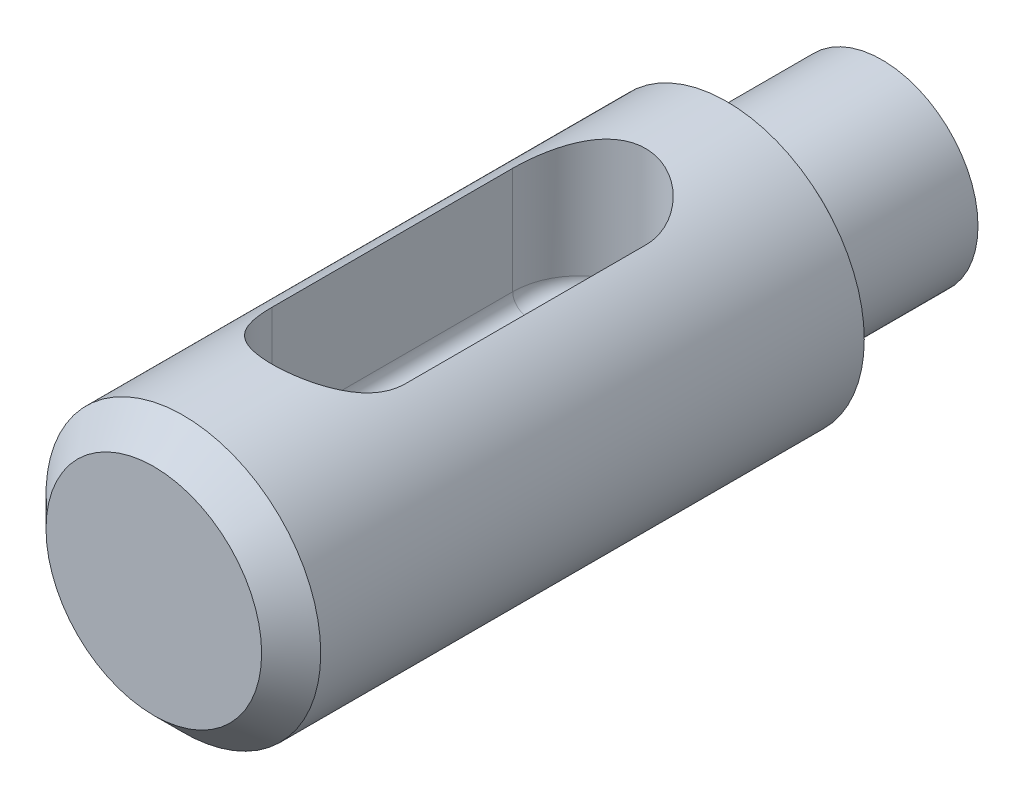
ISO-10303-21;
HEADER;
FILE_DESCRIPTION(('STEP AP214'),'2;1');
FILE_NAME('part.step','',(''),(''),'','','');
FILE_SCHEMA(('AUTOMOTIVE_DESIGN { 1 0 10303 214 1 1 1 1 }'));
ENDSEC;
DATA;
#1=APPLICATION_CONTEXT('core data for automotive mechanical design processes');
#2=APPLICATION_PROTOCOL_DEFINITION('international standard','automotive_design',2000,#1);
#3=PRODUCT_CONTEXT('',#1,'mechanical');
#4=PRODUCT('Part','Part','',(#3));
#5=PRODUCT_RELATED_PRODUCT_CATEGORY('part','',(#4));
#6=PRODUCT_DEFINITION_FORMATION('','',#4);
#7=PRODUCT_DEFINITION_CONTEXT('part definition',#1,'design');
#8=PRODUCT_DEFINITION('design','',#6,#7);
#9=PRODUCT_DEFINITION_SHAPE('','',#8);
#10=(LENGTH_UNIT() NAMED_UNIT(*) SI_UNIT(.MILLI.,.METRE.));
#11=(NAMED_UNIT(*) PLANE_ANGLE_UNIT() SI_UNIT($,.RADIAN.));
#12=(NAMED_UNIT(*) SI_UNIT($,.STERADIAN.) SOLID_ANGLE_UNIT());
#13=UNCERTAINTY_MEASURE_WITH_UNIT(LENGTH_MEASURE(1.E-05),#10,'distance_accuracy_value','');
#14=(GEOMETRIC_REPRESENTATION_CONTEXT(3) GLOBAL_UNCERTAINTY_ASSIGNED_CONTEXT((#13)) GLOBAL_UNIT_ASSIGNED_CONTEXT((#10,
#11,#12)) REPRESENTATION_CONTEXT('',''));
#15=CARTESIAN_POINT('',(0.,0.,0.));
#16=DIRECTION('',(0.,0.,1.));
#17=DIRECTION('',(1.,0.,0.));
#18=AXIS2_PLACEMENT_3D('',#15,#16,#17);
#19=CARTESIAN_POINT('',(0.,0.,0.));
#20=DIRECTION('',(0.,0.,-1.));
#21=DIRECTION('',(-1.,0.,0.));
#22=AXIS2_PLACEMENT_3D('',#19,#20,#21);
#23=PLANE('',#22);
#24=CARTESIAN_POINT('',(0.,0.,0.));
#25=DIRECTION('',(0.,0.,1.));
#26=DIRECTION('',(1.,0.,0.));
#27=AXIS2_PLACEMENT_3D('',#24,#25,#26);
#28=CIRCLE('',#27,1.8542);
#29=CARTESIAN_POINT('',(1.8542,0.,0.));
#30=VERTEX_POINT('',#29);
#31=EDGE_CURVE('E136',#30,#30,#28,.T.);
#32=ORIENTED_EDGE('',*,*,#31,.T.);
#33=EDGE_LOOP('',(#32));
#34=FACE_BOUND('',#33,.T.);
#35=ADVANCED_FACE('F33',(#34),#23,.F.);
#36=CARTESIAN_POINT('',(-1.651,0.,-12.5222));
#37=DIRECTION('',(0.,0.,1.));
#38=DIRECTION('',(1.,0.,0.));
#39=AXIS2_PLACEMENT_3D('',#36,#37,#38);
#40=PLANE('',#39);
#41=CARTESIAN_POINT('',(0.,0.,-12.5222));
#42=DIRECTION('',(0.,0.,1.));
#43=DIRECTION('',(1.,0.,0.));
#44=AXIS2_PLACEMENT_3D('',#41,#42,#43);
#45=CIRCLE('',#44,1.651);
#46=CARTESIAN_POINT('',(1.651,0.,-12.5222));
#47=VERTEX_POINT('',#46);
#48=EDGE_CURVE('E154',#47,#47,#45,.T.);
#49=ORIENTED_EDGE('',*,*,#48,.F.);
#50=EDGE_LOOP('',(#49));
#51=FACE_BOUND('',#50,.T.);
#52=ADVANCED_FACE('F197',(#51),#40,.F.);
#53=CARTESIAN_POINT('',(0.,0.,0.));
#54=DIRECTION('',(0.,0.,1.));
#55=DIRECTION('',(1.,0.,0.));
#56=AXIS2_PLACEMENT_3D('',#53,#54,#55);
#57=CYLINDRICAL_SURFACE('',#56,1.651);
#58=CARTESIAN_POINT('',(0.,0.,-10.3632));
#59=DIRECTION('',(0.,0.,1.));
#60=DIRECTION('',(1.,0.,0.));
#61=AXIS2_PLACEMENT_3D('',#58,#59,#60);
#62=CIRCLE('',#61,1.651);
#63=CARTESIAN_POINT('',(1.651,0.,-10.3632));
#64=VERTEX_POINT('',#63);
#65=EDGE_CURVE('E151',#64,#64,#62,.T.);
#66=ORIENTED_EDGE('',*,*,#65,.F.);
#67=EDGE_LOOP('',(#66));
#68=FACE_BOUND('',#67,.T.);
#69=ORIENTED_EDGE('',*,*,#48,.T.);
#70=EDGE_LOOP('',(#69));
#71=FACE_BOUND('',#70,.T.);
#72=ADVANCED_FACE('F203',(#68,#71),#57,.T.);
#73=CARTESIAN_POINT('',(0.,0.,-10.3632));
#74=DIRECTION('',(0.,0.,1.));
#75=DIRECTION('',(1.,0.,0.));
#76=AXIS2_PLACEMENT_3D('',#73,#74,#75);
#77=TOROIDAL_SURFACE('',#76,2.159,0.508);
#78=CARTESIAN_POINT('',(0.,0.,-9.8552));
#79=DIRECTION('',(0.,0.,1.));
#80=DIRECTION('',(1.,0.,0.));
#81=AXIS2_PLACEMENT_3D('',#78,#79,#80);
#82=CIRCLE('',#81,2.159);
#83=CARTESIAN_POINT('',(2.159,0.,-9.8552));
#84=VERTEX_POINT('',#83);
#85=EDGE_CURVE('E148',#84,#84,#82,.T.);
#86=ORIENTED_EDGE('',*,*,#85,.F.);
#87=EDGE_LOOP('',(#86));
#88=FACE_BOUND('',#87,.T.);
#89=ORIENTED_EDGE('',*,*,#65,.T.);
#90=EDGE_LOOP('',(#89));
#91=FACE_BOUND('',#90,.T.);
#92=ADVANCED_FACE('F294',(#88,#91),#77,.F.);
#93=CARTESIAN_POINT('',(-2.3622,0.,-9.8552));
#94=DIRECTION('',(0.,0.,1.));
#95=DIRECTION('',(1.,0.,0.));
#96=AXIS2_PLACEMENT_3D('',#93,#94,#95);
#97=PLANE('',#96);
#98=CARTESIAN_POINT('',(0.,0.,-9.8552));
#99=DIRECTION('',(0.,0.,1.));
#100=DIRECTION('',(1.,0.,0.));
#101=AXIS2_PLACEMENT_3D('',#98,#99,#100);
#102=CIRCLE('',#101,2.3622);
#103=CARTESIAN_POINT('',(2.3622,0.,-9.8552));
#104=VERTEX_POINT('',#103);
#105=EDGE_CURVE('E145',#104,#104,#102,.T.);
#106=ORIENTED_EDGE('',*,*,#105,.F.);
#107=EDGE_LOOP('',(#106));
#108=FACE_BOUND('',#107,.T.);
#109=ORIENTED_EDGE('',*,*,#85,.T.);
#110=EDGE_LOOP('',(#109));
#111=FACE_BOUND('',#110,.T.);
#112=ADVANCED_FACE('F278',(#108,#111),#97,.F.);
#113=CARTESIAN_POINT('',(0.,0.,0.));
#114=DIRECTION('',(0.,0.,1.));
#115=DIRECTION('',(1.,0.,0.));
#116=AXIS2_PLACEMENT_3D('',#113,#114,#115);
#117=CYLINDRICAL_SURFACE('',#116,2.3622);
#118=DIRECTION('',(0.,0.,1.));
#119=VECTOR('',#118,1.);
#120=CARTESIAN_POINT('',(1.143,2.06725417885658,0.));
#121=LINE('',#120,#119);
#122=CARTESIAN_POINT('',(1.143,2.06725417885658,-7.3152));
#123=VERTEX_POINT('',#122);
#124=CARTESIAN_POINT('',(1.143,2.06725417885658,-3.175));
#125=VERTEX_POINT('',#124);
#126=EDGE_CURVE('E105',#123,#125,#121,.T.);
#127=ORIENTED_EDGE('',*,*,#126,.T.);
#128=CARTESIAN_POINT('',(1.143,2.06725417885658,-3.175));
#129=CARTESIAN_POINT('',(1.143002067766,2.06724859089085,-3.14491238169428));
#130=CARTESIAN_POINT('',(1.14181121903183,2.0679118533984,-3.1148416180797));
#131=CARTESIAN_POINT('',(1.13707538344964,2.07052157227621,-3.05495889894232));
#132=CARTESIAN_POINT('',(1.13353173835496,2.07246729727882,-3.02514680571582));
#133=CARTESIAN_POINT('',(1.11947603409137,2.0801155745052,-2.93675525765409));
#134=CARTESIAN_POINT('',(1.10553827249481,2.08763061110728,-2.8788382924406));
#135=CARTESIAN_POINT('',(1.06917353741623,2.10648239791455,-2.76658770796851));
#136=CARTESIAN_POINT('',(1.04676224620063,2.11781208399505,-2.71224768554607));
#137=CARTESIAN_POINT('',(0.994180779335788,2.14299851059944,-2.6080205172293));
#138=CARTESIAN_POINT('',(0.963999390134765,2.1568588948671,-2.55813994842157));
#139=CARTESIAN_POINT('',(0.89404672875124,2.1868293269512,-2.46013924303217));
#140=CARTESIAN_POINT('',(0.853719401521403,2.20303033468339,-2.41244391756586));
#141=CARTESIAN_POINT('',(0.765784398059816,2.23511824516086,-2.32417347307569));
#142=CARTESIAN_POINT('',(0.718174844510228,2.25100506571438,-2.28360019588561));
#143=CARTESIAN_POINT('',(0.613395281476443,2.28186231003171,-2.20824701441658));
#144=CARTESIAN_POINT('',(0.555814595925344,2.29671410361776,-2.17398505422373));
#145=CARTESIAN_POINT('',(0.434853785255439,2.32265073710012,-2.11582753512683));
#146=CARTESIAN_POINT('',(0.371477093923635,2.33373778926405,-2.09192588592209));
#147=CARTESIAN_POINT('',(0.245248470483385,2.35023750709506,-2.05683209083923));
#148=CARTESIAN_POINT('',(0.18264874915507,2.35598209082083,-2.04489228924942));
#149=CARTESIAN_POINT('',(0.0560894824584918,2.36238197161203,-2.03160819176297));
#150=CARTESIAN_POINT('',(-0.00786930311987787,2.36304004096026,-2.03025812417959));
#151=CARTESIAN_POINT('',(-0.129748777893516,2.35935787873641,-2.03788224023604));
#152=CARTESIAN_POINT('',(-0.187736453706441,2.35542095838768,-2.0460233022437));
#153=CARTESIAN_POINT('',(-0.301401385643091,2.34358952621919,-2.0709204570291));
#154=CARTESIAN_POINT('',(-0.35707851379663,2.33569479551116,-2.08767702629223));
#155=CARTESIAN_POINT('',(-0.465544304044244,2.31653561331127,-2.12946375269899));
#156=CARTESIAN_POINT('',(-0.518279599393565,2.30522411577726,-2.15460996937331));
#157=CARTESIAN_POINT('',(-0.618915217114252,2.28026858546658,-2.21231566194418));
#158=CARTESIAN_POINT('',(-0.666813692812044,2.26662366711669,-2.24487795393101));
#159=CARTESIAN_POINT('',(-0.761006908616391,2.23685295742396,-2.31986262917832));
#160=CARTESIAN_POINT('',(-0.806770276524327,2.22061441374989,-2.36290829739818));
#161=CARTESIAN_POINT('',(-0.890710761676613,2.18829854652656,-2.45596331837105));
#162=CARTESIAN_POINT('',(-0.928881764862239,2.17222136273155,-2.50597822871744));
#163=CARTESIAN_POINT('',(-0.998668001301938,2.14107343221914,-2.61505439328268));
#164=CARTESIAN_POINT('',(-1.02978338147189,2.12611284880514,-2.67446944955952));
#165=CARTESIAN_POINT('',(-1.08130530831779,2.10038213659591,-2.79854672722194));
#166=CARTESIAN_POINT('',(-1.10173607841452,2.08960254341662,-2.86319669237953));
#167=CARTESIAN_POINT('',(-1.12513225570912,2.07705732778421,-2.96953592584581));
#168=CARTESIAN_POINT('',(-1.1318082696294,2.07341326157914,-3.0102182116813));
#169=CARTESIAN_POINT('',(-1.14075105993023,2.06849806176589,-3.09225378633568));
#170=CARTESIAN_POINT('',(-1.14301243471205,2.06722983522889,-3.13360783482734));
#171=CARTESIAN_POINT('',(-1.143,2.06725417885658,-3.175));
#172=B_SPLINE_CURVE_WITH_KNOTS('',3,(#128,#129,#130,#131,#132,#133,#134,#135,#136,#137,#138,
#139,#140,#141,#142,#143,#144,#145,#146,#147,#148,#149,#150,#151,#152,#153,#154,#155,#156,#157,
#158,#159,#160,#161,#162,#163,#164,#165,#166,#167,#168,#169,#170,#171),.UNSPECIFIED.,.F.,.F.,(4,
2,2,2,2,2,2,2,2,2,2,2,2,2,2,2,2,2,2,2,2,4),(0.,0.0901998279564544,0.180348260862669,
0.359514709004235,0.538351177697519,0.717447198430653,0.910210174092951,1.10302292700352,
1.30783974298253,1.51253599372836,1.7034440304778,1.89424801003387,2.06948895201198,
2.24473958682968,2.42252270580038,2.60037344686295,2.79421436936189,2.98821076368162,
3.19330328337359,3.39792879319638,3.52180410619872,3.64583089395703),.UNSPECIFIED.);
#173=CARTESIAN_POINT('',(-1.143,2.06725417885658,-3.175));
#174=VERTEX_POINT('',#173);
#175=EDGE_CURVE('E110',#125,#174,#172,.T.);
#176=ORIENTED_EDGE('',*,*,#175,.T.);
#177=DIRECTION('',(0.,0.,1.));
#178=VECTOR('',#177,1.);
#179=CARTESIAN_POINT('',(-1.143,2.06725417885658,0.));
#180=LINE('',#179,#178);
#181=CARTESIAN_POINT('',(-1.143,2.06725417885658,-7.3152));
#182=VERTEX_POINT('',#181);
#183=EDGE_CURVE('E92',#174,#182,#180,.F.);
#184=ORIENTED_EDGE('',*,*,#183,.T.);
#185=CARTESIAN_POINT('',(-1.143,2.06725417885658,-7.3152));
#186=CARTESIAN_POINT('',(-1.143002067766,2.06724859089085,-7.34528761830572));
#187=CARTESIAN_POINT('',(-1.14181121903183,2.0679118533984,-7.37535838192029));
#188=CARTESIAN_POINT('',(-1.13707538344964,2.07052157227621,-7.43524110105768));
#189=CARTESIAN_POINT('',(-1.13353173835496,2.07246729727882,-7.46505319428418));
#190=CARTESIAN_POINT('',(-1.11947603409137,2.0801155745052,-7.55344474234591));
#191=CARTESIAN_POINT('',(-1.10553827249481,2.08763061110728,-7.6113617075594));
#192=CARTESIAN_POINT('',(-1.06917353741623,2.10648239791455,-7.72361229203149));
#193=CARTESIAN_POINT('',(-1.04676224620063,2.11781208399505,-7.77795231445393));
#194=CARTESIAN_POINT('',(-0.994180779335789,2.14299851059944,-7.88217948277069));
#195=CARTESIAN_POINT('',(-0.963999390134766,2.1568588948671,-7.93206005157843));
#196=CARTESIAN_POINT('',(-0.894046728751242,2.1868293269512,-8.03006075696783));
#197=CARTESIAN_POINT('',(-0.853719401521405,2.20303033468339,-8.07775608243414));
#198=CARTESIAN_POINT('',(-0.765784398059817,2.23511824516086,-8.16602652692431));
#199=CARTESIAN_POINT('',(-0.718174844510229,2.25100506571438,-8.20659980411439));
#200=CARTESIAN_POINT('',(-0.613395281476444,2.28186231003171,-8.28195298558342));
#201=CARTESIAN_POINT('',(-0.555814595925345,2.29671410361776,-8.31621494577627));
#202=CARTESIAN_POINT('',(-0.434853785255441,2.32265073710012,-8.37437246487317));
#203=CARTESIAN_POINT('',(-0.371477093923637,2.33373778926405,-8.39827411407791));
#204=CARTESIAN_POINT('',(-0.245248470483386,2.35023750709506,-8.43336790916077));
#205=CARTESIAN_POINT('',(-0.18264874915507,2.35598209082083,-8.44530771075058));
#206=CARTESIAN_POINT('',(-0.0560894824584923,2.36238197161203,-8.45859180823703));
#207=CARTESIAN_POINT('',(0.00786930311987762,2.36304004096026,-8.45994187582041));
#208=CARTESIAN_POINT('',(0.129748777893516,2.35935787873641,-8.45231775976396));
#209=CARTESIAN_POINT('',(0.187736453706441,2.35542095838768,-8.4441766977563));
#210=CARTESIAN_POINT('',(0.301401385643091,2.34358952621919,-8.41927954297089));
#211=CARTESIAN_POINT('',(0.357078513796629,2.33569479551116,-8.40252297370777));
#212=CARTESIAN_POINT('',(0.465544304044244,2.31653561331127,-8.36073624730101));
#213=CARTESIAN_POINT('',(0.518279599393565,2.30522411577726,-8.33559003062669));
#214=CARTESIAN_POINT('',(0.618915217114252,2.28026858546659,-8.27788433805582));
#215=CARTESIAN_POINT('',(0.666813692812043,2.26662366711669,-8.24532204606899));
#216=CARTESIAN_POINT('',(0.761006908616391,2.23685295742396,-8.17033737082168));
#217=CARTESIAN_POINT('',(0.806770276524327,2.22061441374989,-8.12729170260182));
#218=CARTESIAN_POINT('',(0.890710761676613,2.18829854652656,-8.03423668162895));
#219=CARTESIAN_POINT('',(0.92888176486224,2.17222136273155,-7.98422177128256));
#220=CARTESIAN_POINT('',(0.998668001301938,2.14107343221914,-7.87514560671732));
#221=CARTESIAN_POINT('',(1.02978338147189,2.12611284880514,-7.81573055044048));
#222=CARTESIAN_POINT('',(1.08130530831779,2.10038213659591,-7.69165327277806));
#223=CARTESIAN_POINT('',(1.10173607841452,2.08960254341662,-7.62700330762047));
#224=CARTESIAN_POINT('',(1.12513225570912,2.07705732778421,-7.52066407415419));
#225=CARTESIAN_POINT('',(1.1318082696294,2.07341326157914,-7.47998178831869));
#226=CARTESIAN_POINT('',(1.14075105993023,2.06849806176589,-7.39794621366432));
#227=CARTESIAN_POINT('',(1.14301243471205,2.06722983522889,-7.35659216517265));
#228=CARTESIAN_POINT('',(1.143,2.06725417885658,-7.3152));
#229=B_SPLINE_CURVE_WITH_KNOTS('',3,(#185,#186,#187,#188,#189,#190,#191,#192,#193,#194,#195,
#196,#197,#198,#199,#200,#201,#202,#203,#204,#205,#206,#207,#208,#209,#210,#211,#212,#213,#214,
#215,#216,#217,#218,#219,#220,#221,#222,#223,#224,#225,#226,#227,#228),.UNSPECIFIED.,.F.,.F.,(4,
2,2,2,2,2,2,2,2,2,2,2,2,2,2,2,2,2,2,2,2,4),(0.,0.0901998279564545,0.18034826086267,
0.359514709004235,0.538351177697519,0.717447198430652,0.91021017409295,1.10302292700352,
1.30783974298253,1.51253599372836,1.7034440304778,1.89424801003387,2.06948895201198,
2.24473958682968,2.42252270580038,2.60037344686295,2.79421436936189,2.98821076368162,
3.1933032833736,3.39792879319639,3.52180410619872,3.64583089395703),.UNSPECIFIED.);
#230=EDGE_CURVE('E100',#182,#123,#229,.T.);
#231=ORIENTED_EDGE('',*,*,#230,.T.);
#232=EDGE_LOOP('',(#127,#176,#184,#231));
#233=FACE_BOUND('',#232,.T.);
#234=CARTESIAN_POINT('',(0.,0.,-0.507999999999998));
#235=DIRECTION('',(0.,0.,1.));
#236=DIRECTION('',(1.,0.,0.));
#237=AXIS2_PLACEMENT_3D('',#234,#235,#236);
#238=CIRCLE('',#237,2.3622);
#239=CARTESIAN_POINT('',(2.3622,0.,-0.507999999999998));
#240=VERTEX_POINT('',#239);
#241=EDGE_CURVE('E142',#240,#240,#238,.T.);
#242=ORIENTED_EDGE('',*,*,#241,.F.);
#243=EDGE_LOOP('',(#242));
#244=FACE_BOUND('',#243,.T.);
#245=ORIENTED_EDGE('',*,*,#105,.T.);
#246=EDGE_LOOP('',(#245));
#247=FACE_BOUND('',#246,.T.);
#248=ADVANCED_FACE('F107',(#233,#244,#247),#117,.T.);
#249=CARTESIAN_POINT('',(0.,0.,-0.507999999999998));
#250=DIRECTION('',(0.,0.,-1.));
#251=DIRECTION('',(-1.,0.,0.));
#252=AXIS2_PLACEMENT_3D('',#249,#250,#251);
#253=CONICAL_SURFACE('',#252,2.3622,0.78539816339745);
#254=ORIENTED_EDGE('',*,*,#31,.F.);
#255=EDGE_LOOP('',(#254));
#256=FACE_BOUND('',#255,.T.);
#257=ORIENTED_EDGE('',*,*,#241,.T.);
#258=EDGE_LOOP('',(#257));
#259=FACE_BOUND('',#258,.T.);
#260=ADVANCED_FACE('F266',(#256,#259),#253,.T.);
#261=CARTESIAN_POINT('',(0.,-0.0254,-3.175));
#262=DIRECTION('',(0.,1.,0.));
#263=DIRECTION('',(0.,0.,1.));
#264=AXIS2_PLACEMENT_3D('',#261,#262,#263);
#265=CYLINDRICAL_SURFACE('',#264,1.143);
#266=DIRECTION('',(0.,1.,0.));
#267=VECTOR('',#266,1.);
#268=CARTESIAN_POINT('',(1.143,-0.0254,-3.175));
#269=LINE('',#268,#267);
#270=CARTESIAN_POINT('',(1.143,0.2286,-3.175));
#271=VERTEX_POINT('',#270);
#272=EDGE_CURVE('E122',#271,#125,#269,.T.);
#273=ORIENTED_EDGE('',*,*,#272,.F.);
#274=CARTESIAN_POINT('',(0.,0.2286,-3.175));
#275=DIRECTION('',(0.,1.,0.));
#276=DIRECTION('',(0.,0.,1.));
#277=AXIS2_PLACEMENT_3D('',#274,#275,#276);
#278=CIRCLE('',#277,1.143);
#279=CARTESIAN_POINT('',(-1.143,0.2286,-3.175));
#280=VERTEX_POINT('',#279);
#281=EDGE_CURVE('E11',#271,#280,#278,.F.);
#282=ORIENTED_EDGE('',*,*,#281,.T.);
#283=DIRECTION('',(0.,1.,0.));
#284=VECTOR('',#283,1.);
#285=CARTESIAN_POINT('',(-1.143,-0.0254,-3.175));
#286=LINE('',#285,#284);
#287=EDGE_CURVE('E96',#280,#174,#286,.T.);
#288=ORIENTED_EDGE('',*,*,#287,.T.);
#289=ORIENTED_EDGE('',*,*,#175,.F.);
#290=EDGE_LOOP('',(#273,#282,#288,#289));
#291=FACE_BOUND('',#290,.T.);
#292=ADVANCED_FACE('F258',(#291),#265,.F.);
#293=CARTESIAN_POINT('',(-1.143,-0.0254,-3.175));
#294=DIRECTION('',(-1.,0.,0.));
#295=DIRECTION('',(0.,0.,1.));
#296=AXIS2_PLACEMENT_3D('',#293,#294,#295);
#297=PLANE('',#296);
#298=ORIENTED_EDGE('',*,*,#287,.F.);
#299=DIRECTION('',(0.,0.,1.));
#300=VECTOR('',#299,1.);
#301=CARTESIAN_POINT('',(-1.143,0.2286,-3.175));
#302=LINE('',#301,#300);
#303=CARTESIAN_POINT('',(-1.143,0.2286,-7.3152));
#304=VERTEX_POINT('',#303);
#305=EDGE_CURVE('E95',#280,#304,#302,.F.);
#306=ORIENTED_EDGE('',*,*,#305,.T.);
#307=DIRECTION('',(0.,1.,0.));
#308=VECTOR('',#307,1.);
#309=CARTESIAN_POINT('',(-1.143,-0.0254,-7.3152));
#310=LINE('',#309,#308);
#311=EDGE_CURVE('E87',#304,#182,#310,.T.);
#312=ORIENTED_EDGE('',*,*,#311,.T.);
#313=ORIENTED_EDGE('',*,*,#183,.F.);
#314=EDGE_LOOP('',(#298,#306,#312,#313));
#315=FACE_BOUND('',#314,.T.);
#316=ADVANCED_FACE('F90',(#315),#297,.F.);
#317=CARTESIAN_POINT('',(0.,-0.0254,-7.3152));
#318=DIRECTION('',(0.,1.,0.));
#319=DIRECTION('',(0.,0.,1.));
#320=AXIS2_PLACEMENT_3D('',#317,#318,#319);
#321=CYLINDRICAL_SURFACE('',#320,1.143);
#322=ORIENTED_EDGE('',*,*,#311,.F.);
#323=CARTESIAN_POINT('',(0.,0.2286,-7.3152));
#324=DIRECTION('',(0.,1.,0.));
#325=DIRECTION('',(0.,0.,1.));
#326=AXIS2_PLACEMENT_3D('',#323,#324,#325);
#327=CIRCLE('',#326,1.143);
#328=CARTESIAN_POINT('',(1.143,0.2286,-7.3152));
#329=VERTEX_POINT('',#328);
#330=EDGE_CURVE('E57',#304,#329,#327,.F.);
#331=ORIENTED_EDGE('',*,*,#330,.T.);
#332=DIRECTION('',(0.,1.,0.));
#333=VECTOR('',#332,1.);
#334=CARTESIAN_POINT('',(1.143,-0.0254,-7.3152));
#335=LINE('',#334,#333);
#336=EDGE_CURVE('E97',#329,#123,#335,.T.);
#337=ORIENTED_EDGE('',*,*,#336,.T.);
#338=ORIENTED_EDGE('',*,*,#230,.F.);
#339=EDGE_LOOP('',(#322,#331,#337,#338));
#340=FACE_BOUND('',#339,.T.);
#341=ADVANCED_FACE('F101',(#340),#321,.F.);
#342=CARTESIAN_POINT('',(1.143,-0.0254,-3.175));
#343=DIRECTION('',(1.,0.,0.));
#344=DIRECTION('',(0.,0.,-1.));
#345=AXIS2_PLACEMENT_3D('',#342,#343,#344);
#346=PLANE('',#345);
#347=ORIENTED_EDGE('',*,*,#336,.F.);
#348=DIRECTION('',(0.,0.,-1.));
#349=VECTOR('',#348,1.);
#350=CARTESIAN_POINT('',(1.143,0.2286,-3.175));
#351=LINE('',#350,#349);
#352=EDGE_CURVE('E42',#329,#271,#351,.F.);
#353=ORIENTED_EDGE('',*,*,#352,.T.);
#354=ORIENTED_EDGE('',*,*,#272,.T.);
#355=ORIENTED_EDGE('',*,*,#126,.F.);
#356=EDGE_LOOP('',(#347,#353,#354,#355));
#357=FACE_BOUND('',#356,.T.);
#358=ADVANCED_FACE('F234',(#357),#346,.F.);
#359=CARTESIAN_POINT('',(0.,-0.0254,-3.175));
#360=DIRECTION('',(0.,1.,0.));
#361=DIRECTION('',(0.,0.,1.));
#362=AXIS2_PLACEMENT_3D('',#359,#360,#361);
#363=PLANE('',#362);
#364=CARTESIAN_POINT('',(0.,-0.0254,-7.3152));
#365=DIRECTION('',(0.,1.,0.));
#366=DIRECTION('',(0.,0.,1.));
#367=AXIS2_PLACEMENT_3D('',#364,#365,#366);
#368=CIRCLE('',#367,0.889);
#369=CARTESIAN_POINT('',(0.889,-0.0254,-7.3152));
#370=VERTEX_POINT('',#369);
#371=CARTESIAN_POINT('',(-0.889,-0.0254,-7.3152));
#372=VERTEX_POINT('',#371);
#373=EDGE_CURVE('E161',#370,#372,#368,.T.);
#374=ORIENTED_EDGE('',*,*,#373,.T.);
#375=DIRECTION('',(0.,0.,1.));
#376=VECTOR('',#375,1.);
#377=CARTESIAN_POINT('',(-0.889,-0.0254,-3.175));
#378=LINE('',#377,#376);
#379=CARTESIAN_POINT('',(-0.889,-0.0254,-3.175));
#380=VERTEX_POINT('',#379);
#381=EDGE_CURVE('E163',#372,#380,#378,.T.);
#382=ORIENTED_EDGE('',*,*,#381,.T.);
#383=CARTESIAN_POINT('',(0.,-0.0254,-3.175));
#384=DIRECTION('',(0.,1.,0.));
#385=DIRECTION('',(0.,0.,1.));
#386=AXIS2_PLACEMENT_3D('',#383,#384,#385);
#387=CIRCLE('',#386,0.889);
#388=CARTESIAN_POINT('',(0.889,-0.0254,-3.175));
#389=VERTEX_POINT('',#388);
#390=EDGE_CURVE('E157',#380,#389,#387,.T.);
#391=ORIENTED_EDGE('',*,*,#390,.T.);
#392=DIRECTION('',(0.,0.,-1.));
#393=VECTOR('',#392,1.);
#394=CARTESIAN_POINT('',(0.889,-0.0254,-3.175));
#395=LINE('',#394,#393);
#396=EDGE_CURVE('E159',#389,#370,#395,.T.);
#397=ORIENTED_EDGE('',*,*,#396,.T.);
#398=EDGE_LOOP('',(#374,#382,#391,#397));
#399=FACE_BOUND('',#398,.T.);
#400=ADVANCED_FACE('F128',(#399),#363,.T.);
#401=CARTESIAN_POINT('',(0.889,0.2286,-3.175));
#402=DIRECTION('',(0.,0.,-1.));
#403=DIRECTION('',(-1.,0.,0.));
#404=AXIS2_PLACEMENT_3D('',#401,#402,#403);
#405=CYLINDRICAL_SURFACE('',#404,0.254);
#406=CARTESIAN_POINT('',(0.889,0.2286,-3.175));
#407=DIRECTION('',(0.,0.,-1.));
#408=DIRECTION('',(-1.,0.,0.));
#409=AXIS2_PLACEMENT_3D('',#406,#407,#408);
#410=CIRCLE('',#409,0.254);
#411=EDGE_CURVE('E113',#271,#389,#410,.T.);
#412=ORIENTED_EDGE('',*,*,#411,.F.);
#413=ORIENTED_EDGE('',*,*,#352,.F.);
#414=CARTESIAN_POINT('',(0.889,0.2286,-7.3152));
#415=DIRECTION('',(0.,0.,1.));
#416=DIRECTION('',(1.,0.,0.));
#417=AXIS2_PLACEMENT_3D('',#414,#415,#416);
#418=CIRCLE('',#417,0.254);
#419=EDGE_CURVE('E37',#370,#329,#418,.T.);
#420=ORIENTED_EDGE('',*,*,#419,.F.);
#421=ORIENTED_EDGE('',*,*,#396,.F.);
#422=EDGE_LOOP('',(#412,#413,#420,#421));
#423=FACE_BOUND('',#422,.T.);
#424=ADVANCED_FACE('F35',(#423),#405,.F.);
#425=CARTESIAN_POINT('',(0.,0.2286,-7.3152));
#426=DIRECTION('',(0.,1.,0.));
#427=DIRECTION('',(0.,0.,1.));
#428=AXIS2_PLACEMENT_3D('',#425,#426,#427);
#429=TOROIDAL_SURFACE('',#428,0.889,0.254);
#430=ORIENTED_EDGE('',*,*,#419,.T.);
#431=ORIENTED_EDGE('',*,*,#330,.F.);
#432=CARTESIAN_POINT('',(-0.889,0.2286,-7.3152));
#433=DIRECTION('',(0.,0.,-1.));
#434=DIRECTION('',(-1.,0.,0.));
#435=AXIS2_PLACEMENT_3D('',#432,#433,#434);
#436=CIRCLE('',#435,0.254);
#437=EDGE_CURVE('E171',#372,#304,#436,.T.);
#438=ORIENTED_EDGE('',*,*,#437,.F.);
#439=ORIENTED_EDGE('',*,*,#373,.F.);
#440=EDGE_LOOP('',(#430,#431,#438,#439));
#441=FACE_BOUND('',#440,.T.);
#442=ADVANCED_FACE('F189',(#441),#429,.F.);
#443=CARTESIAN_POINT('',(0.,0.2286,-3.175));
#444=DIRECTION('',(0.,1.,0.));
#445=DIRECTION('',(0.,0.,1.));
#446=AXIS2_PLACEMENT_3D('',#443,#444,#445);
#447=TOROIDAL_SURFACE('',#446,0.889,0.254);
#448=ORIENTED_EDGE('',*,*,#411,.T.);
#449=ORIENTED_EDGE('',*,*,#390,.F.);
#450=CARTESIAN_POINT('',(-0.889,0.2286,-3.175));
#451=DIRECTION('',(0.,0.,1.));
#452=DIRECTION('',(1.,0.,0.));
#453=AXIS2_PLACEMENT_3D('',#450,#451,#452);
#454=CIRCLE('',#453,0.254);
#455=EDGE_CURVE('E169',#280,#380,#454,.T.);
#456=ORIENTED_EDGE('',*,*,#455,.F.);
#457=ORIENTED_EDGE('',*,*,#281,.F.);
#458=EDGE_LOOP('',(#448,#449,#456,#457));
#459=FACE_BOUND('',#458,.T.);
#460=ADVANCED_FACE('F177',(#459),#447,.F.);
#461=CARTESIAN_POINT('',(-0.889,0.2286,-3.175));
#462=DIRECTION('',(0.,0.,1.));
#463=DIRECTION('',(1.,0.,0.));
#464=AXIS2_PLACEMENT_3D('',#461,#462,#463);
#465=CYLINDRICAL_SURFACE('',#464,0.254);
#466=ORIENTED_EDGE('',*,*,#437,.T.);
#467=ORIENTED_EDGE('',*,*,#305,.F.);
#468=ORIENTED_EDGE('',*,*,#455,.T.);
#469=ORIENTED_EDGE('',*,*,#381,.F.);
#470=EDGE_LOOP('',(#466,#467,#468,#469));
#471=FACE_BOUND('',#470,.T.);
#472=ADVANCED_FACE('F187',(#471),#465,.F.);
#473=CLOSED_SHELL('',(#35,#52,#72,#92,#112,#248,#260,#292,#316,#341,#358,#400,#424,#442,#460,#472));
#474=MANIFOLD_SOLID_BREP('B2',#473);
#475=ADVANCED_BREP_SHAPE_REPRESENTATION('',(#18,#474),#14);
#476=SHAPE_DEFINITION_REPRESENTATION(#9,#475);
ENDSEC;
END-ISO-10303-21;
